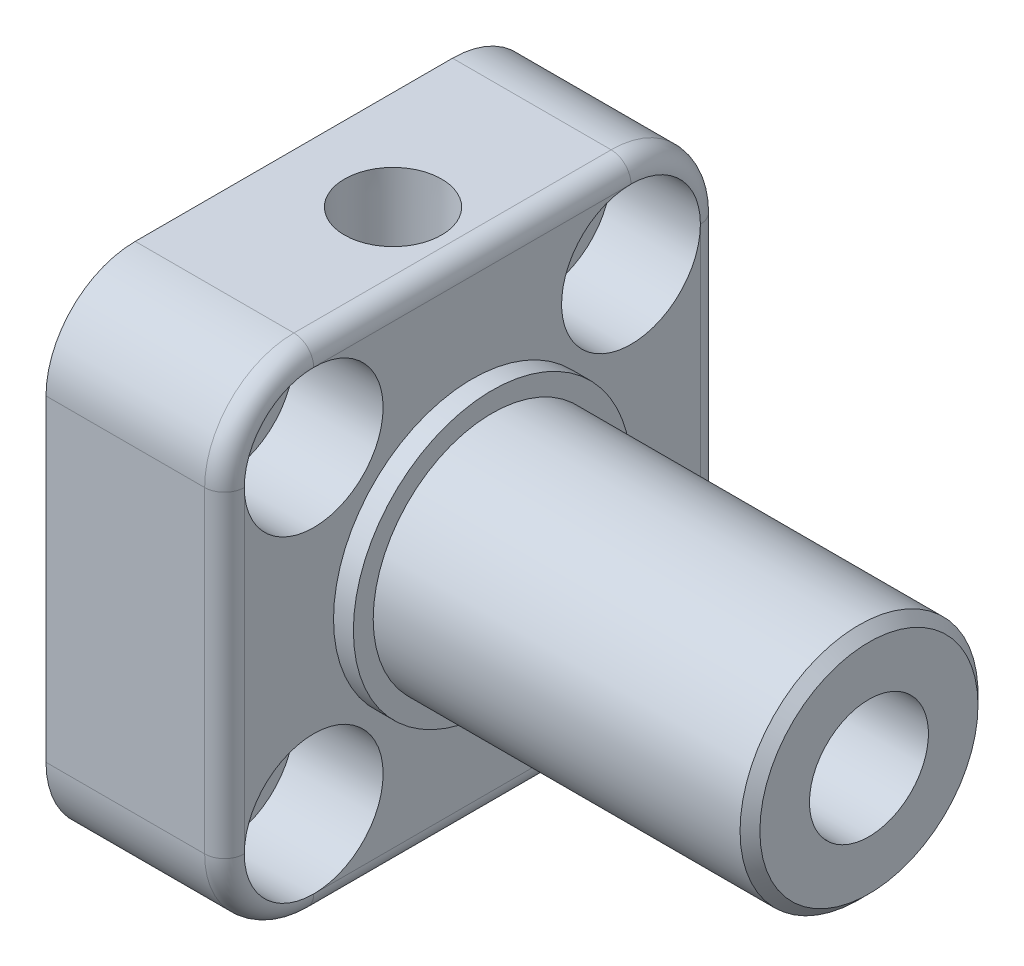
ISO-10303-21;
HEADER;
FILE_DESCRIPTION(('STEP AP214'),'2;1');
FILE_NAME('part.step','',(''),(''),'','','');
FILE_SCHEMA(('AUTOMOTIVE_DESIGN { 1 0 10303 214 1 1 1 1 }'));
ENDSEC;
DATA;
#1=APPLICATION_CONTEXT('core data for automotive mechanical design processes');
#2=APPLICATION_PROTOCOL_DEFINITION('international standard','automotive_design',2000,#1);
#3=PRODUCT_CONTEXT('',#1,'mechanical');
#4=PRODUCT('Part','Part','',(#3));
#5=PRODUCT_RELATED_PRODUCT_CATEGORY('part','',(#4));
#6=PRODUCT_DEFINITION_FORMATION('','',#4);
#7=PRODUCT_DEFINITION_CONTEXT('part definition',#1,'design');
#8=PRODUCT_DEFINITION('design','',#6,#7);
#9=PRODUCT_DEFINITION_SHAPE('','',#8);
#10=(LENGTH_UNIT() NAMED_UNIT(*) SI_UNIT(.MILLI.,.METRE.));
#11=(NAMED_UNIT(*) PLANE_ANGLE_UNIT() SI_UNIT($,.RADIAN.));
#12=(NAMED_UNIT(*) SI_UNIT($,.STERADIAN.) SOLID_ANGLE_UNIT());
#13=UNCERTAINTY_MEASURE_WITH_UNIT(LENGTH_MEASURE(1.E-05),#10,'distance_accuracy_value','');
#14=(GEOMETRIC_REPRESENTATION_CONTEXT(3) GLOBAL_UNCERTAINTY_ASSIGNED_CONTEXT((#13)) GLOBAL_UNIT_ASSIGNED_CONTEXT((#10,
#11,#12)) REPRESENTATION_CONTEXT('',''));
#15=CARTESIAN_POINT('',(0.,0.,0.));
#16=DIRECTION('',(0.,0.,1.));
#17=DIRECTION('',(1.,0.,0.));
#18=AXIS2_PLACEMENT_3D('',#15,#16,#17);
#19=CARTESIAN_POINT('',(8.,-16.,16.));
#20=DIRECTION('',(-1.,0.,0.));
#21=DIRECTION('',(0.,0.,1.));
#22=AXIS2_PLACEMENT_3D('',#19,#20,#21);
#23=CYLINDRICAL_SURFACE('',#22,4.5);
#24=CARTESIAN_POINT('',(-10.,-16.,16.));
#25=DIRECTION('',(1.,0.,0.));
#26=DIRECTION('',(0.,0.,-1.));
#27=AXIS2_PLACEMENT_3D('',#24,#25,#26);
#28=CIRCLE('',#27,4.5);
#29=CARTESIAN_POINT('',(-10.,-16.,11.5));
#30=VERTEX_POINT('',#29);
#31=EDGE_CURVE('E338',#30,#30,#28,.T.);
#32=ORIENTED_EDGE('',*,*,#31,.F.);
#33=EDGE_LOOP('',(#32));
#34=FACE_BOUND('',#33,.T.);
#35=CARTESIAN_POINT('',(-1.,-16.,16.));
#36=DIRECTION('',(1.,0.,0.));
#37=DIRECTION('',(0.,0.,-1.));
#38=AXIS2_PLACEMENT_3D('',#35,#36,#37);
#39=CIRCLE('',#38,4.5);
#40=CARTESIAN_POINT('',(-1.,-16.,11.5));
#41=VERTEX_POINT('',#40);
#42=EDGE_CURVE('E190',#41,#41,#39,.T.);
#43=ORIENTED_EDGE('',*,*,#42,.T.);
#44=EDGE_LOOP('',(#43));
#45=FACE_BOUND('',#44,.T.);
#46=ADVANCED_FACE('F28',(#34,#45),#23,.F.);
#47=CARTESIAN_POINT('',(8.,-16.,-16.));
#48=DIRECTION('',(-1.,0.,0.));
#49=DIRECTION('',(0.,0.,1.));
#50=AXIS2_PLACEMENT_3D('',#47,#48,#49);
#51=CYLINDRICAL_SURFACE('',#50,4.5);
#52=CARTESIAN_POINT('',(-10.,-16.,-16.));
#53=DIRECTION('',(1.,0.,0.));
#54=DIRECTION('',(0.,0.,-1.));
#55=AXIS2_PLACEMENT_3D('',#52,#53,#54);
#56=CIRCLE('',#55,4.5);
#57=CARTESIAN_POINT('',(-10.,-16.,-20.5));
#58=VERTEX_POINT('',#57);
#59=EDGE_CURVE('E141',#58,#58,#56,.T.);
#60=ORIENTED_EDGE('',*,*,#59,.F.);
#61=EDGE_LOOP('',(#60));
#62=FACE_BOUND('',#61,.T.);
#63=CARTESIAN_POINT('',(-1.,-16.,-16.));
#64=DIRECTION('',(1.,0.,0.));
#65=DIRECTION('',(0.,0.,-1.));
#66=AXIS2_PLACEMENT_3D('',#63,#64,#65);
#67=CIRCLE('',#66,4.5);
#68=CARTESIAN_POINT('',(-1.,-16.,-20.5));
#69=VERTEX_POINT('',#68);
#70=EDGE_CURVE('E185',#69,#69,#67,.T.);
#71=ORIENTED_EDGE('',*,*,#70,.T.);
#72=EDGE_LOOP('',(#71));
#73=FACE_BOUND('',#72,.T.);
#74=ADVANCED_FACE('F352',(#62,#73),#51,.F.);
#75=CARTESIAN_POINT('',(8.,16.,-16.));
#76=DIRECTION('',(-1.,0.,0.));
#77=DIRECTION('',(0.,0.,1.));
#78=AXIS2_PLACEMENT_3D('',#75,#76,#77);
#79=CYLINDRICAL_SURFACE('',#78,4.5);
#80=CARTESIAN_POINT('',(-10.,16.,-16.));
#81=DIRECTION('',(1.,0.,0.));
#82=DIRECTION('',(0.,0.,-1.));
#83=AXIS2_PLACEMENT_3D('',#80,#81,#82);
#84=CIRCLE('',#83,4.5);
#85=CARTESIAN_POINT('',(-10.,16.,-20.5));
#86=VERTEX_POINT('',#85);
#87=EDGE_CURVE('E144',#86,#86,#84,.T.);
#88=ORIENTED_EDGE('',*,*,#87,.F.);
#89=EDGE_LOOP('',(#88));
#90=FACE_BOUND('',#89,.T.);
#91=CARTESIAN_POINT('',(-1.,16.,-16.));
#92=DIRECTION('',(1.,0.,0.));
#93=DIRECTION('',(0.,0.,-1.));
#94=AXIS2_PLACEMENT_3D('',#91,#92,#93);
#95=CIRCLE('',#94,4.5);
#96=CARTESIAN_POINT('',(-1.,16.,-20.5));
#97=VERTEX_POINT('',#96);
#98=EDGE_CURVE('E180',#97,#97,#95,.T.);
#99=ORIENTED_EDGE('',*,*,#98,.T.);
#100=EDGE_LOOP('',(#99));
#101=FACE_BOUND('',#100,.T.);
#102=ADVANCED_FACE('F348',(#90,#101),#79,.F.);
#103=CARTESIAN_POINT('',(8.,16.,16.));
#104=DIRECTION('',(-1.,0.,0.));
#105=DIRECTION('',(0.,0.,1.));
#106=AXIS2_PLACEMENT_3D('',#103,#104,#105);
#107=CYLINDRICAL_SURFACE('',#106,4.5);
#108=CARTESIAN_POINT('',(-10.,16.,16.));
#109=DIRECTION('',(1.,0.,0.));
#110=DIRECTION('',(0.,0.,-1.));
#111=AXIS2_PLACEMENT_3D('',#108,#109,#110);
#112=CIRCLE('',#111,4.5);
#113=CARTESIAN_POINT('',(-10.,16.,11.5));
#114=VERTEX_POINT('',#113);
#115=EDGE_CURVE('E341',#114,#114,#112,.T.);
#116=ORIENTED_EDGE('',*,*,#115,.F.);
#117=EDGE_LOOP('',(#116));
#118=FACE_BOUND('',#117,.T.);
#119=CARTESIAN_POINT('',(-1.,16.,16.));
#120=DIRECTION('',(1.,0.,0.));
#121=DIRECTION('',(0.,0.,-1.));
#122=AXIS2_PLACEMENT_3D('',#119,#120,#121);
#123=CIRCLE('',#122,4.5);
#124=CARTESIAN_POINT('',(-1.,16.,11.5));
#125=VERTEX_POINT('',#124);
#126=EDGE_CURVE('E175',#125,#125,#123,.T.);
#127=ORIENTED_EDGE('',*,*,#126,.T.);
#128=EDGE_LOOP('',(#127));
#129=FACE_BOUND('',#128,.T.);
#130=ADVANCED_FACE('F351',(#118,#129),#107,.F.);
#131=CARTESIAN_POINT('',(8.,16.,-16.));
#132=DIRECTION('',(1.,0.,0.));
#133=DIRECTION('',(0.,0.,-1.));
#134=AXIS2_PLACEMENT_3D('',#131,#132,#133);
#135=PLANE('',#134);
#136=CARTESIAN_POINT('',(8.,-16.,-16.));
#137=DIRECTION('',(1.,0.,0.));
#138=DIRECTION('',(0.,0.,-1.));
#139=AXIS2_PLACEMENT_3D('',#136,#137,#138);
#140=CIRCLE('',#139,7.);
#141=CARTESIAN_POINT('',(8.,-16.,-23.));
#142=VERTEX_POINT('',#141);
#143=CARTESIAN_POINT('',(8.,-23.,-16.));
#144=VERTEX_POINT('',#143);
#145=EDGE_CURVE('E291',#142,#144,#140,.T.);
#146=ORIENTED_EDGE('',*,*,#145,.F.);
#147=DIRECTION('',(0.,1.,0.));
#148=VECTOR('',#147,1.);
#149=CARTESIAN_POINT('',(8.,15.9999999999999,-23.));
#150=LINE('',#149,#148);
#151=CARTESIAN_POINT('',(8.,16.,-23.));
#152=VERTEX_POINT('',#151);
#153=EDGE_CURVE('E200',#142,#152,#150,.T.);
#154=ORIENTED_EDGE('',*,*,#153,.T.);
#155=CARTESIAN_POINT('',(8.,16.,-16.));
#156=DIRECTION('',(1.,0.,0.));
#157=DIRECTION('',(0.,0.,-1.));
#158=AXIS2_PLACEMENT_3D('',#155,#156,#157);
#159=CIRCLE('',#158,7.);
#160=CARTESIAN_POINT('',(8.,23.,-16.));
#161=VERTEX_POINT('',#160);
#162=EDGE_CURVE('E188',#161,#152,#159,.T.);
#163=ORIENTED_EDGE('',*,*,#162,.F.);
#164=DIRECTION('',(0.,0.,1.));
#165=VECTOR('',#164,1.);
#166=CARTESIAN_POINT('',(8.,23.,15.9999999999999));
#167=LINE('',#166,#165);
#168=CARTESIAN_POINT('',(8.,23.,16.));
#169=VERTEX_POINT('',#168);
#170=EDGE_CURVE('E124',#161,#169,#167,.T.);
#171=ORIENTED_EDGE('',*,*,#170,.T.);
#172=CARTESIAN_POINT('',(8.,16.,16.));
#173=DIRECTION('',(1.,0.,0.));
#174=DIRECTION('',(0.,0.,-1.));
#175=AXIS2_PLACEMENT_3D('',#172,#173,#174);
#176=CIRCLE('',#175,7.);
#177=CARTESIAN_POINT('',(8.,15.9999999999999,23.));
#178=VERTEX_POINT('',#177);
#179=EDGE_CURVE('E183',#178,#169,#176,.T.);
#180=ORIENTED_EDGE('',*,*,#179,.F.);
#181=DIRECTION('',(0.,-1.,0.));
#182=VECTOR('',#181,1.);
#183=CARTESIAN_POINT('',(8.,-15.9999999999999,23.));
#184=LINE('',#183,#182);
#185=CARTESIAN_POINT('',(8.,-16.,23.));
#186=VERTEX_POINT('',#185);
#187=EDGE_CURVE('E196',#178,#186,#184,.T.);
#188=ORIENTED_EDGE('',*,*,#187,.T.);
#189=CARTESIAN_POINT('',(8.,-16.,16.));
#190=DIRECTION('',(1.,0.,0.));
#191=DIRECTION('',(0.,0.,-1.));
#192=AXIS2_PLACEMENT_3D('',#189,#190,#191);
#193=CIRCLE('',#192,7.);
#194=CARTESIAN_POINT('',(8.,-23.,15.9999999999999));
#195=VERTEX_POINT('',#194);
#196=EDGE_CURVE('E286',#195,#186,#193,.T.);
#197=ORIENTED_EDGE('',*,*,#196,.F.);
#198=DIRECTION('',(0.,0.,-1.));
#199=VECTOR('',#198,1.);
#200=CARTESIAN_POINT('',(8.,-23.,-15.9999999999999));
#201=LINE('',#200,#199);
#202=EDGE_CURVE('E198',#195,#144,#201,.T.);
#203=ORIENTED_EDGE('',*,*,#202,.T.);
#204=EDGE_LOOP('',(#146,#154,#163,#171,#180,#188,#197,#203));
#205=FACE_BOUND('',#204,.T.);
#206=CARTESIAN_POINT('',(8.,0.,0.));
#207=DIRECTION('',(-1.,0.,0.));
#208=DIRECTION('',(0.,0.,1.));
#209=AXIS2_PLACEMENT_3D('',#206,#207,#208);
#210=CIRCLE('',#209,14.);
#211=CARTESIAN_POINT('',(8.,0.,14.));
#212=VERTEX_POINT('',#211);
#213=EDGE_CURVE('E335',#212,#212,#210,.T.);
#214=ORIENTED_EDGE('',*,*,#213,.T.);
#215=EDGE_LOOP('',(#214));
#216=FACE_BOUND('',#215,.T.);
#217=ADVANCED_FACE('F414',(#205,#216),#135,.T.);
#218=CARTESIAN_POINT('',(-10.,16.,-16.));
#219=DIRECTION('',(1.,0.,0.));
#220=DIRECTION('',(0.,0.,-1.));
#221=AXIS2_PLACEMENT_3D('',#218,#219,#220);
#222=PLANE('',#221);
#223=CARTESIAN_POINT('',(-10.,16.,0.));
#224=DIRECTION('',(-1.,0.,0.));
#225=DIRECTION('',(0.,0.,1.));
#226=AXIS2_PLACEMENT_3D('',#223,#224,#225);
#227=CIRCLE('',#226,2.);
#228=CARTESIAN_POINT('',(-10.,16.,2.));
#229=VERTEX_POINT('',#228);
#230=EDGE_CURVE('E246',#229,#229,#227,.T.);
#231=ORIENTED_EDGE('',*,*,#230,.F.);
#232=EDGE_LOOP('',(#231));
#233=FACE_BOUND('',#232,.T.);
#234=CARTESIAN_POINT('',(-10.,0.,0.));
#235=DIRECTION('',(-1.,0.,0.));
#236=DIRECTION('',(0.,0.,1.));
#237=AXIS2_PLACEMENT_3D('',#234,#235,#236);
#238=CIRCLE('',#237,11.15);
#239=CARTESIAN_POINT('',(-10.,0.,11.15));
#240=VERTEX_POINT('',#239);
#241=EDGE_CURVE('E308',#240,#240,#238,.T.);
#242=ORIENTED_EDGE('',*,*,#241,.F.);
#243=EDGE_LOOP('',(#242));
#244=FACE_BOUND('',#243,.T.);
#245=CARTESIAN_POINT('',(-10.,16.,-16.));
#246=DIRECTION('',(1.,0.,0.));
#247=DIRECTION('',(0.,0.,-1.));
#248=AXIS2_PLACEMENT_3D('',#245,#246,#247);
#249=CIRCLE('',#248,9.);
#250=CARTESIAN_POINT('',(-10.,15.9999999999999,-25.));
#251=VERTEX_POINT('',#250);
#252=CARTESIAN_POINT('',(-10.,25.,-15.9999999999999));
#253=VERTEX_POINT('',#252);
#254=EDGE_CURVE('E133',#251,#253,#249,.T.);
#255=ORIENTED_EDGE('',*,*,#254,.F.);
#256=DIRECTION('',(0.,1.,0.));
#257=VECTOR('',#256,1.);
#258=CARTESIAN_POINT('',(-10.,-15.9999999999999,-25.));
#259=LINE('',#258,#257);
#260=CARTESIAN_POINT('',(-10.,-15.9999999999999,-25.));
#261=VERTEX_POINT('',#260);
#262=EDGE_CURVE('E161',#261,#251,#259,.T.);
#263=ORIENTED_EDGE('',*,*,#262,.F.);
#264=CARTESIAN_POINT('',(-10.,-16.,-16.));
#265=DIRECTION('',(1.,0.,0.));
#266=DIRECTION('',(0.,0.,-1.));
#267=AXIS2_PLACEMENT_3D('',#264,#265,#266);
#268=CIRCLE('',#267,9.);
#269=CARTESIAN_POINT('',(-10.,-25.,-15.9999999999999));
#270=VERTEX_POINT('',#269);
#271=EDGE_CURVE('E158',#270,#261,#268,.T.);
#272=ORIENTED_EDGE('',*,*,#271,.F.);
#273=DIRECTION('',(0.,0.,-1.));
#274=VECTOR('',#273,1.);
#275=CARTESIAN_POINT('',(-10.,-25.,15.9999999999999));
#276=LINE('',#275,#274);
#277=CARTESIAN_POINT('',(-10.,-25.,15.9999999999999));
#278=VERTEX_POINT('',#277);
#279=EDGE_CURVE('E155',#278,#270,#276,.T.);
#280=ORIENTED_EDGE('',*,*,#279,.F.);
#281=CARTESIAN_POINT('',(-10.,-16.,16.));
#282=DIRECTION('',(1.,0.,0.));
#283=DIRECTION('',(0.,0.,1.));
#284=AXIS2_PLACEMENT_3D('',#281,#282,#283);
#285=CIRCLE('',#284,9.);
#286=CARTESIAN_POINT('',(-10.,-15.9999999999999,25.));
#287=VERTEX_POINT('',#286);
#288=EDGE_CURVE('E152',#287,#278,#285,.T.);
#289=ORIENTED_EDGE('',*,*,#288,.F.);
#290=DIRECTION('',(0.,-1.,0.));
#291=VECTOR('',#290,1.);
#292=CARTESIAN_POINT('',(-10.,15.9999999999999,25.));
#293=LINE('',#292,#291);
#294=CARTESIAN_POINT('',(-10.,15.9999999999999,25.));
#295=VERTEX_POINT('',#294);
#296=EDGE_CURVE('E149',#295,#287,#293,.T.);
#297=ORIENTED_EDGE('',*,*,#296,.F.);
#298=CARTESIAN_POINT('',(-10.,16.,16.));
#299=DIRECTION('',(1.,0.,0.));
#300=DIRECTION('',(0.,0.,1.));
#301=AXIS2_PLACEMENT_3D('',#298,#299,#300);
#302=CIRCLE('',#301,9.);
#303=CARTESIAN_POINT('',(-10.,25.,15.9999999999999));
#304=VERTEX_POINT('',#303);
#305=EDGE_CURVE('E137',#304,#295,#302,.T.);
#306=ORIENTED_EDGE('',*,*,#305,.F.);
#307=DIRECTION('',(0.,0.,1.));
#308=VECTOR('',#307,1.);
#309=CARTESIAN_POINT('',(-10.,25.,-15.9999999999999));
#310=LINE('',#309,#308);
#311=EDGE_CURVE('E119',#253,#304,#310,.T.);
#312=ORIENTED_EDGE('',*,*,#311,.F.);
#313=EDGE_LOOP('',(#255,#263,#272,#280,#289,#297,#306,#312));
#314=FACE_BOUND('',#313,.T.);
#315=ORIENTED_EDGE('',*,*,#59,.T.);
#316=EDGE_LOOP('',(#315));
#317=FACE_BOUND('',#316,.T.);
#318=ORIENTED_EDGE('',*,*,#87,.T.);
#319=EDGE_LOOP('',(#318));
#320=FACE_BOUND('',#319,.T.);
#321=ORIENTED_EDGE('',*,*,#115,.T.);
#322=EDGE_LOOP('',(#321));
#323=FACE_BOUND('',#322,.T.);
#324=ORIENTED_EDGE('',*,*,#31,.T.);
#325=EDGE_LOOP('',(#324));
#326=FACE_BOUND('',#325,.T.);
#327=ADVANCED_FACE('F130',(#233,#244,#314,#317,#320,#323,#326),#222,.F.);
#328=CARTESIAN_POINT('',(8.,16.,-16.));
#329=DIRECTION('',(-1.,0.,0.));
#330=DIRECTION('',(0.,0.,1.));
#331=AXIS2_PLACEMENT_3D('',#328,#329,#330);
#332=CYLINDRICAL_SURFACE('',#331,9.);
#333=DIRECTION('',(-1.,0.,0.));
#334=VECTOR('',#333,1.);
#335=CARTESIAN_POINT('',(8.,25.,-15.9999999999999));
#336=LINE('',#335,#334);
#337=CARTESIAN_POINT('',(6.,25.,-15.9999999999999));
#338=VERTEX_POINT('',#337);
#339=EDGE_CURVE('E116',#338,#253,#336,.T.);
#340=ORIENTED_EDGE('',*,*,#339,.F.);
#341=CARTESIAN_POINT('',(6.,16.,-16.));
#342=DIRECTION('',(1.,0.,0.));
#343=DIRECTION('',(0.,0.,-1.));
#344=AXIS2_PLACEMENT_3D('',#341,#342,#343);
#345=CIRCLE('',#344,9.);
#346=CARTESIAN_POINT('',(6.,15.9999999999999,-25.));
#347=VERTEX_POINT('',#346);
#348=EDGE_CURVE('E207',#338,#347,#345,.F.);
#349=ORIENTED_EDGE('',*,*,#348,.T.);
#350=DIRECTION('',(-1.,0.,0.));
#351=VECTOR('',#350,1.);
#352=CARTESIAN_POINT('',(8.,15.9999999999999,-25.));
#353=LINE('',#352,#351);
#354=EDGE_CURVE('E140',#347,#251,#353,.T.);
#355=ORIENTED_EDGE('',*,*,#354,.T.);
#356=ORIENTED_EDGE('',*,*,#254,.T.);
#357=EDGE_LOOP('',(#340,#349,#355,#356));
#358=FACE_BOUND('',#357,.T.);
#359=ADVANCED_FACE('F30',(#358),#332,.T.);
#360=CARTESIAN_POINT('',(8.,25.,-15.9999999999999));
#361=DIRECTION('',(0.,-1.,0.));
#362=DIRECTION('',(0.,0.,-1.));
#363=AXIS2_PLACEMENT_3D('',#360,#361,#362);
#364=PLANE('',#363);
#365=CARTESIAN_POINT('',(0.,25.,0.));
#366=DIRECTION('',(0.,1.,0.));
#367=DIRECTION('',(0.,0.,1.));
#368=AXIS2_PLACEMENT_3D('',#365,#366,#367);
#369=CIRCLE('',#368,4.8967009);
#370=CARTESIAN_POINT('',(0.,25.,4.89670089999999));
#371=VERTEX_POINT('',#370);
#372=EDGE_CURVE('E256',#371,#371,#369,.T.);
#373=ORIENTED_EDGE('',*,*,#372,.F.);
#374=EDGE_LOOP('',(#373));
#375=FACE_BOUND('',#374,.T.);
#376=DIRECTION('',(-1.,0.,0.));
#377=VECTOR('',#376,1.);
#378=CARTESIAN_POINT('',(8.,25.,15.9999999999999));
#379=LINE('',#378,#377);
#380=CARTESIAN_POINT('',(6.,25.,15.9999999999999));
#381=VERTEX_POINT('',#380);
#382=EDGE_CURVE('E125',#381,#304,#379,.T.);
#383=ORIENTED_EDGE('',*,*,#382,.F.);
#384=DIRECTION('',(0.,0.,1.));
#385=VECTOR('',#384,1.);
#386=CARTESIAN_POINT('',(6.,25.,-15.9999999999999));
#387=LINE('',#386,#385);
#388=EDGE_CURVE('E11',#381,#338,#387,.F.);
#389=ORIENTED_EDGE('',*,*,#388,.T.);
#390=ORIENTED_EDGE('',*,*,#339,.T.);
#391=ORIENTED_EDGE('',*,*,#311,.T.);
#392=EDGE_LOOP('',(#383,#389,#390,#391));
#393=FACE_BOUND('',#392,.T.);
#394=ADVANCED_FACE('F118',(#375,#393),#364,.F.);
#395=CARTESIAN_POINT('',(8.,16.,16.));
#396=DIRECTION('',(-1.,0.,0.));
#397=DIRECTION('',(0.,0.,1.));
#398=AXIS2_PLACEMENT_3D('',#395,#396,#397);
#399=CYLINDRICAL_SURFACE('',#398,9.);
#400=DIRECTION('',(-1.,0.,0.));
#401=VECTOR('',#400,1.);
#402=CARTESIAN_POINT('',(8.,15.9999999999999,25.));
#403=LINE('',#402,#401);
#404=CARTESIAN_POINT('',(6.,15.9999999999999,25.));
#405=VERTEX_POINT('',#404);
#406=EDGE_CURVE('E172',#405,#295,#403,.T.);
#407=ORIENTED_EDGE('',*,*,#406,.F.);
#408=CARTESIAN_POINT('',(6.,16.,16.));
#409=DIRECTION('',(1.,0.,0.));
#410=DIRECTION('',(0.,0.,-1.));
#411=AXIS2_PLACEMENT_3D('',#408,#409,#410);
#412=CIRCLE('',#411,9.);
#413=EDGE_CURVE('E36',#405,#381,#412,.F.);
#414=ORIENTED_EDGE('',*,*,#413,.T.);
#415=ORIENTED_EDGE('',*,*,#382,.T.);
#416=ORIENTED_EDGE('',*,*,#305,.T.);
#417=EDGE_LOOP('',(#407,#414,#415,#416));
#418=FACE_BOUND('',#417,.T.);
#419=ADVANCED_FACE('F467',(#418),#399,.T.);
#420=CARTESIAN_POINT('',(8.,15.9999999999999,25.));
#421=DIRECTION('',(0.,0.,-1.));
#422=DIRECTION('',(0.,1.,0.));
#423=AXIS2_PLACEMENT_3D('',#420,#421,#422);
#424=PLANE('',#423);
#425=DIRECTION('',(-1.,0.,0.));
#426=VECTOR('',#425,1.);
#427=CARTESIAN_POINT('',(8.,-15.9999999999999,25.));
#428=LINE('',#427,#426);
#429=CARTESIAN_POINT('',(6.,-15.9999999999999,25.));
#430=VERTEX_POINT('',#429);
#431=EDGE_CURVE('E170',#430,#287,#428,.T.);
#432=ORIENTED_EDGE('',*,*,#431,.F.);
#433=DIRECTION('',(0.,-1.,0.));
#434=VECTOR('',#433,1.);
#435=CARTESIAN_POINT('',(6.,15.9999999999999,25.));
#436=LINE('',#435,#434);
#437=EDGE_CURVE('E50',#430,#405,#436,.F.);
#438=ORIENTED_EDGE('',*,*,#437,.T.);
#439=ORIENTED_EDGE('',*,*,#406,.T.);
#440=ORIENTED_EDGE('',*,*,#296,.T.);
#441=EDGE_LOOP('',(#432,#438,#439,#440));
#442=FACE_BOUND('',#441,.T.);
#443=ADVANCED_FACE('F222',(#442),#424,.F.);
#444=CARTESIAN_POINT('',(8.,-16.,16.));
#445=DIRECTION('',(-1.,0.,0.));
#446=DIRECTION('',(0.,0.,1.));
#447=AXIS2_PLACEMENT_3D('',#444,#445,#446);
#448=CYLINDRICAL_SURFACE('',#447,9.);
#449=DIRECTION('',(-1.,0.,0.));
#450=VECTOR('',#449,1.);
#451=CARTESIAN_POINT('',(8.,-25.,15.9999999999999));
#452=LINE('',#451,#450);
#453=CARTESIAN_POINT('',(6.,-25.,15.9999999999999));
#454=VERTEX_POINT('',#453);
#455=EDGE_CURVE('E168',#454,#278,#452,.T.);
#456=ORIENTED_EDGE('',*,*,#455,.F.);
#457=CARTESIAN_POINT('',(6.,-16.,16.));
#458=DIRECTION('',(1.,0.,0.));
#459=DIRECTION('',(0.,0.,-1.));
#460=AXIS2_PLACEMENT_3D('',#457,#458,#459);
#461=CIRCLE('',#460,9.);
#462=EDGE_CURVE('E211',#454,#430,#461,.F.);
#463=ORIENTED_EDGE('',*,*,#462,.T.);
#464=ORIENTED_EDGE('',*,*,#431,.T.);
#465=ORIENTED_EDGE('',*,*,#288,.T.);
#466=EDGE_LOOP('',(#456,#463,#464,#465));
#467=FACE_BOUND('',#466,.T.);
#468=ADVANCED_FACE('F216',(#467),#448,.T.);
#469=CARTESIAN_POINT('',(8.,-25.,15.9999999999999));
#470=DIRECTION('',(0.,1.,0.));
#471=DIRECTION('',(0.,0.,1.));
#472=AXIS2_PLACEMENT_3D('',#469,#470,#471);
#473=PLANE('',#472);
#474=DIRECTION('',(-1.,0.,0.));
#475=VECTOR('',#474,1.);
#476=CARTESIAN_POINT('',(8.,-25.,-15.9999999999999));
#477=LINE('',#476,#475);
#478=CARTESIAN_POINT('',(6.,-25.,-15.9999999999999));
#479=VERTEX_POINT('',#478);
#480=EDGE_CURVE('E166',#479,#270,#477,.T.);
#481=ORIENTED_EDGE('',*,*,#480,.F.);
#482=DIRECTION('',(0.,0.,-1.));
#483=VECTOR('',#482,1.);
#484=CARTESIAN_POINT('',(6.,-25.,15.9999999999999));
#485=LINE('',#484,#483);
#486=EDGE_CURVE('E209',#479,#454,#485,.F.);
#487=ORIENTED_EDGE('',*,*,#486,.T.);
#488=ORIENTED_EDGE('',*,*,#455,.T.);
#489=ORIENTED_EDGE('',*,*,#279,.T.);
#490=EDGE_LOOP('',(#481,#487,#488,#489));
#491=FACE_BOUND('',#490,.T.);
#492=ADVANCED_FACE('F391',(#491),#473,.F.);
#493=CARTESIAN_POINT('',(8.,-16.,-16.));
#494=DIRECTION('',(-1.,0.,0.));
#495=DIRECTION('',(0.,0.,1.));
#496=AXIS2_PLACEMENT_3D('',#493,#494,#495);
#497=CYLINDRICAL_SURFACE('',#496,9.);
#498=DIRECTION('',(-1.,0.,0.));
#499=VECTOR('',#498,1.);
#500=CARTESIAN_POINT('',(8.,-15.9999999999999,-25.));
#501=LINE('',#500,#499);
#502=CARTESIAN_POINT('',(6.,-15.9999999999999,-25.));
#503=VERTEX_POINT('',#502);
#504=EDGE_CURVE('E164',#503,#261,#501,.T.);
#505=ORIENTED_EDGE('',*,*,#504,.F.);
#506=CARTESIAN_POINT('',(6.,-16.,-16.));
#507=DIRECTION('',(1.,0.,0.));
#508=DIRECTION('',(0.,0.,-1.));
#509=AXIS2_PLACEMENT_3D('',#506,#507,#508);
#510=CIRCLE('',#509,9.);
#511=EDGE_CURVE('E202',#503,#479,#510,.F.);
#512=ORIENTED_EDGE('',*,*,#511,.T.);
#513=ORIENTED_EDGE('',*,*,#480,.T.);
#514=ORIENTED_EDGE('',*,*,#271,.T.);
#515=EDGE_LOOP('',(#505,#512,#513,#514));
#516=FACE_BOUND('',#515,.T.);
#517=ADVANCED_FACE('F400',(#516),#497,.T.);
#518=CARTESIAN_POINT('',(8.,-15.9999999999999,-25.));
#519=DIRECTION('',(0.,0.,1.));
#520=DIRECTION('',(0.,-1.,0.));
#521=AXIS2_PLACEMENT_3D('',#518,#519,#520);
#522=PLANE('',#521);
#523=ORIENTED_EDGE('',*,*,#354,.F.);
#524=DIRECTION('',(0.,1.,0.));
#525=VECTOR('',#524,1.);
#526=CARTESIAN_POINT('',(6.,-15.9999999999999,-25.));
#527=LINE('',#526,#525);
#528=EDGE_CURVE('E205',#347,#503,#527,.F.);
#529=ORIENTED_EDGE('',*,*,#528,.T.);
#530=ORIENTED_EDGE('',*,*,#504,.T.);
#531=ORIENTED_EDGE('',*,*,#262,.T.);
#532=EDGE_LOOP('',(#523,#529,#530,#531));
#533=FACE_BOUND('',#532,.T.);
#534=ADVANCED_FACE('F384',(#533),#522,.F.);
#535=CARTESIAN_POINT('',(-12.,6.,0.));
#536=DIRECTION('',(1.,0.,0.));
#537=DIRECTION('',(0.,0.,-1.));
#538=AXIS2_PLACEMENT_3D('',#535,#536,#537);
#539=PLANE('',#538);
#540=CARTESIAN_POINT('',(-12.,0.,0.));
#541=DIRECTION('',(-1.,0.,0.));
#542=DIRECTION('',(0.,0.,1.));
#543=AXIS2_PLACEMENT_3D('',#540,#541,#542);
#544=CIRCLE('',#543,6.);
#545=CARTESIAN_POINT('',(-12.,0.,6.));
#546=VERTEX_POINT('',#545);
#547=EDGE_CURVE('E317',#546,#546,#544,.T.);
#548=ORIENTED_EDGE('',*,*,#547,.F.);
#549=EDGE_LOOP('',(#548));
#550=FACE_BOUND('',#549,.T.);
#551=CARTESIAN_POINT('',(-12.,0.,0.));
#552=DIRECTION('',(-1.,0.,0.));
#553=DIRECTION('',(0.,0.,1.));
#554=AXIS2_PLACEMENT_3D('',#551,#552,#553);
#555=CIRCLE('',#554,8.);
#556=CARTESIAN_POINT('',(-12.,0.,8.));
#557=VERTEX_POINT('',#556);
#558=EDGE_CURVE('E314',#557,#557,#555,.T.);
#559=ORIENTED_EDGE('',*,*,#558,.T.);
#560=EDGE_LOOP('',(#559));
#561=FACE_BOUND('',#560,.T.);
#562=ADVANCED_FACE('F458',(#550,#561),#539,.F.);
#563=CARTESIAN_POINT('',(0.,0.,0.));
#564=DIRECTION('',(-1.,0.,0.));
#565=DIRECTION('',(0.,0.,1.));
#566=AXIS2_PLACEMENT_3D('',#563,#564,#565);
#567=CYLINDRICAL_SURFACE('',#566,8.);
#568=ORIENTED_EDGE('',*,*,#558,.F.);
#569=EDGE_LOOP('',(#568));
#570=FACE_BOUND('',#569,.T.);
#571=CARTESIAN_POINT('',(-8.,0.,0.));
#572=DIRECTION('',(-1.,0.,0.));
#573=DIRECTION('',(0.,0.,1.));
#574=AXIS2_PLACEMENT_3D('',#571,#572,#573);
#575=CIRCLE('',#574,8.);
#576=CARTESIAN_POINT('',(-8.,0.,8.));
#577=VERTEX_POINT('',#576);
#578=EDGE_CURVE('E178',#577,#577,#575,.T.);
#579=ORIENTED_EDGE('',*,*,#578,.T.);
#580=EDGE_LOOP('',(#579));
#581=FACE_BOUND('',#580,.T.);
#582=ADVANCED_FACE('F452',(#570,#581),#567,.T.);
#583=CARTESIAN_POINT('',(8.,0.,0.));
#584=DIRECTION('',(-1.,0.,0.));
#585=DIRECTION('',(0.,0.,1.));
#586=AXIS2_PLACEMENT_3D('',#583,#584,#585);
#587=CYLINDRICAL_SURFACE('',#586,6.);
#588=CARTESIAN_POINT('',(0.,4.26872007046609,4.2164));
#589=CARTESIAN_POINT('',(-0.101064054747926,4.26872006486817,4.21640000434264));
#590=CARTESIAN_POINT('',(-0.202131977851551,4.27232640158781,4.2127582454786));
#591=CARTESIAN_POINT('',(-0.40325198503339,4.28655050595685,4.19828366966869));
#592=CARTESIAN_POINT('',(-0.503303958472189,4.29716902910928,4.18745007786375));
#593=CARTESIAN_POINT('',(-0.701660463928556,4.32488544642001,4.1588171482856));
#594=CARTESIAN_POINT('',(-0.799961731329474,4.34199433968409,4.14100598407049));
#595=CARTESIAN_POINT('',(-0.993976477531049,4.38188658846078,4.09876959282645));
#596=CARTESIAN_POINT('',(-1.08968851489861,4.40467303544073,4.07434076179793));
#597=CARTESIAN_POINT('',(-1.36990713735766,4.47956478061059,3.9923583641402));
#598=CARTESIAN_POINT('',(-1.54998305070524,4.53859164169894,3.92573367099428));
#599=CARTESIAN_POINT('',(-1.89586000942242,4.66802111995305,3.77090724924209));
#600=CARTESIAN_POINT('',(-2.06166030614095,4.73842433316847,3.68270438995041));
#601=CARTESIAN_POINT('',(-2.40651436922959,4.89754213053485,3.46912166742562));
#602=CARTESIAN_POINT('',(-2.58272740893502,4.98729329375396,3.33992580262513));
#603=CARTESIAN_POINT('',(-2.913583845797,5.16639183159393,3.05559438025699));
#604=CARTESIAN_POINT('',(-3.06819988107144,5.25573855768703,2.90042645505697));
#605=CARTESIAN_POINT('',(-3.29393209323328,5.39143523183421,2.63525098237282));
#606=CARTESIAN_POINT('',(-3.37307040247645,5.44024001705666,2.53322858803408));
#607=CARTESIAN_POINT('',(-3.52234663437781,5.53403263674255,2.32118587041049));
#608=CARTESIAN_POINT('',(-3.59248861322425,5.5790221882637,2.21116918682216));
#609=CARTESIAN_POINT('',(-3.72289279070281,5.66387286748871,1.98374568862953));
#610=CARTESIAN_POINT('',(-3.78316796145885,5.70374071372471,1.86634886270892));
#611=CARTESIAN_POINT('',(-3.89300914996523,5.77718168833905,1.62484302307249));
#612=CARTESIAN_POINT('',(-3.94257988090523,5.8107575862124,1.50073699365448));
#613=CARTESIAN_POINT('',(-4.05012280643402,5.88415363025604,1.1885997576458));
#614=CARTESIAN_POINT('',(-4.10159325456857,5.91982277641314,0.997258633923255));
#615=CARTESIAN_POINT('',(-4.17722599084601,5.97247440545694,0.606882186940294));
#616=CARTESIAN_POINT('',(-4.20141018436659,5.98947187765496,0.407853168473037));
#617=CARTESIAN_POINT('',(-4.22116704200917,6.00334644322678,0.0072477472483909));
#618=CARTESIAN_POINT('',(-4.21668317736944,6.00018378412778,-0.19433290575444));
#619=CARTESIAN_POINT('',(-4.17923351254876,5.97392583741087,-0.593511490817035));
#620=CARTESIAN_POINT('',(-4.14625983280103,5.95082503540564,-0.791108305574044));
#621=CARTESIAN_POINT('',(-4.05478824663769,5.8874633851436,-1.17229333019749));
#622=CARTESIAN_POINT('',(-3.99690610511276,5.84761702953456,-1.35610122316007));
#623=CARTESIAN_POINT('',(-3.85835307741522,5.75380447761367,-1.71098518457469));
#624=CARTESIAN_POINT('',(-3.7776776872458,5.69983549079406,-1.88205872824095));
#625=CARTESIAN_POINT('',(-3.58604682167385,5.57457177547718,-2.22745693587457));
#626=CARTESIAN_POINT('',(-3.47271045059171,5.50201289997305,-2.39999541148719));
#627=CARTESIAN_POINT('',(-3.22431803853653,5.34870480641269,-2.72464364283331));
#628=CARTESIAN_POINT('',(-3.08923885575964,5.26794689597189,-2.8767313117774));
#629=CARTESIAN_POINT('',(-2.773488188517,5.08864290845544,-3.18477611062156));
#630=CARTESIAN_POINT('',(-2.58898590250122,4.98950869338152,-3.33651485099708));
#631=CARTESIAN_POINT('',(-2.29372703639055,4.84518826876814,-3.53993251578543));
#632=CARTESIAN_POINT('',(-2.19218200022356,4.79779481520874,-3.60372586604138));
#633=CARTESIAN_POINT('',(-1.98304698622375,4.70591084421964,-3.7229090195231));
#634=CARTESIAN_POINT('',(-1.87545806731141,4.66141982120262,-3.77830028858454));
#635=CARTESIAN_POINT('',(-1.59480607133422,4.55419917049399,-3.90763675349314));
#636=CARTESIAN_POINT('',(-1.41764008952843,4.49452376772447,-3.97554661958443));
#637=CARTESIAN_POINT('',(-1.14304160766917,4.41823332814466,-4.05963717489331));
#638=CARTESIAN_POINT('',(-1.05006799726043,4.3950127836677,-4.08469931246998));
#639=CARTESIAN_POINT('',(-0.861532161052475,4.35382138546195,-4.12857656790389));
#640=CARTESIAN_POINT('',(-0.765971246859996,4.3358479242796,-4.14739478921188));
#641=CARTESIAN_POINT('',(-0.571788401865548,4.30576558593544,-4.17861962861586));
#642=CARTESIAN_POINT('',(-0.473144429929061,4.29372295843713,-4.19095391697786));
#643=CARTESIAN_POINT('',(-0.274635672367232,4.27640301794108,-4.20862587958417));
#644=CARTESIAN_POINT('',(-0.174770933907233,4.27112544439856,-4.21396382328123));
#645=CARTESIAN_POINT('',(0.0251807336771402,4.26762513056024,-4.21750927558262));
#646=CARTESIAN_POINT('',(0.125267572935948,4.26939992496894,-4.21571927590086));
#647=CARTESIAN_POINT('',(0.32466680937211,4.27988806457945,-4.20506898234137));
#648=CARTESIAN_POINT('',(0.423979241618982,4.28860109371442,-4.19620901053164));
#649=CARTESIAN_POINT('',(0.691238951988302,4.32109308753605,-4.16281918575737));
#650=CARTESIAN_POINT('',(0.857647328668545,4.35118420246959,-4.13162133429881));
#651=CARTESIAN_POINT('',(1.18221288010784,4.42656684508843,-4.05074302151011));
#652=CARTESIAN_POINT('',(1.34036097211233,4.47187471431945,-4.00104268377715));
#653=CARTESIAN_POINT('',(1.71941011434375,4.59704733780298,-3.85745027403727));
#654=CARTESIAN_POINT('',(1.93460962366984,4.68312068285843,-3.75377496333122));
#655=CARTESIAN_POINT('',(2.2396146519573,4.81970821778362,-3.57437227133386));
#656=CARTESIAN_POINT('',(2.33844272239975,4.86655427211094,-3.51048382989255));
#657=CARTESIAN_POINT('',(2.53004865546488,4.96147159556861,-3.37500145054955));
#658=CARTESIAN_POINT('',(2.62282722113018,5.00954272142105,-3.30340841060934));
#659=CARTESIAN_POINT('',(2.89525176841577,5.15563297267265,-3.07450171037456));
#660=CARTESIAN_POINT('',(3.0651344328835,5.2537192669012,-2.90532849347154));
#661=CARTESIAN_POINT('',(3.37558376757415,5.44070614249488,-2.53794856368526));
#662=CARTESIAN_POINT('',(3.5161929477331,5.52961994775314,-2.33978467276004));
#663=CARTESIAN_POINT('',(3.74388306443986,5.67735797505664,-1.95031674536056));
#664=CARTESIAN_POINT('',(3.83591806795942,5.73871815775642,-1.76291793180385));
#665=CARTESIAN_POINT('',(3.95318474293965,5.81797446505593,-1.47018640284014));
#666=CARTESIAN_POINT('',(3.9888162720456,5.84226749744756,-1.37064134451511));
#667=CARTESIAN_POINT('',(4.0527216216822,5.88608344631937,-1.16821354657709));
#668=CARTESIAN_POINT('',(4.08099863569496,5.90560843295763,-1.06533227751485));
#669=CARTESIAN_POINT('',(4.12995181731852,5.93954211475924,-0.856231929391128));
#670=CARTESIAN_POINT('',(4.15057805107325,5.95391717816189,-0.749995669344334));
#671=CARTESIAN_POINT('',(4.18363609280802,5.97700942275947,-0.535691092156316));
#672=CARTESIAN_POINT('',(4.19607160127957,5.98572915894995,-0.427623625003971));
#673=CARTESIAN_POINT('',(4.21254628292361,5.99728961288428,-0.210546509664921));
#674=CARTESIAN_POINT('',(4.21658630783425,6.00013092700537,-0.101536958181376));
#675=CARTESIAN_POINT('',(4.21620050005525,5.9998598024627,0.116453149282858));
#676=CARTESIAN_POINT('',(4.21177532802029,5.99674782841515,0.225433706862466));
#677=CARTESIAN_POINT('',(4.1953928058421,5.98525366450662,0.431647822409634));
#678=CARTESIAN_POINT('',(4.18422476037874,5.97742390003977,0.528975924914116));
#679=CARTESIAN_POINT('',(4.15524556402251,5.95717493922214,0.722163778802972));
#680=CARTESIAN_POINT('',(4.13743230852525,5.94475428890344,0.818023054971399));
#681=CARTESIAN_POINT('',(4.07435335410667,5.90096426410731,1.1023980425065));
#682=CARTESIAN_POINT('',(4.01943472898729,5.86305691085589,1.28787774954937));
#683=CARTESIAN_POINT('',(3.88423040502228,5.77119444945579,1.65223088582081));
#684=CARTESIAN_POINT('',(3.80317066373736,5.71675308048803,1.83068714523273));
#685=CARTESIAN_POINT('',(3.6193290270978,5.59613275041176,2.17163895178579));
#686=CARTESIAN_POINT('',(3.51654300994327,5.52995156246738,2.33413146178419));
#687=CARTESIAN_POINT('',(3.27433877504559,5.37893297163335,2.66556191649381));
#688=CARTESIAN_POINT('',(3.13170718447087,5.29279585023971,2.8315494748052));
#689=CARTESIAN_POINT('',(2.82355185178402,5.11647857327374,3.13896189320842));
#690=CARTESIAN_POINT('',(2.65798131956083,5.0262904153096,3.28033518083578));
#691=CARTESIAN_POINT('',(2.3798499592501,4.88650310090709,3.48285570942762));
#692=CARTESIAN_POINT('',(2.27417664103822,4.83574326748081,3.55278425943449));
#693=CARTESIAN_POINT('',(2.05599862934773,4.73704640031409,3.6833540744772));
#694=CARTESIAN_POINT('',(1.94349204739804,4.68911015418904,3.74399275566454));
#695=CARTESIAN_POINT('',(1.5965152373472,4.55255509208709,3.91085206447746));
#696=CARTESIAN_POINT('',(1.35178508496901,4.47075920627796,4.00260706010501));
#697=CARTESIAN_POINT('',(0.920713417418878,4.36360068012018,4.11864958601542));
#698=CARTESIAN_POINT('',(0.740071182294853,4.32858795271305,4.15506517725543));
#699=CARTESIAN_POINT('',(0.46472872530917,4.29297064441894,4.19173640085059));
#700=CARTESIAN_POINT('',(0.37225439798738,4.28391540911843,4.20096801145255));
#701=CARTESIAN_POINT('',(0.186520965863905,4.27179111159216,4.21329879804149));
#702=CARTESIAN_POINT('',(0.0932621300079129,4.26872007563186,4.2163999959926));
#703=CARTESIAN_POINT('',(0.,4.26872007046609,4.2164));
#704=B_SPLINE_CURVE_WITH_KNOTS('',3,(#588,#589,#590,#591,#592,#593,#594,#595,#596,#597,#598,
#599,#600,#601,#602,#603,#604,#605,#606,#607,#608,#609,#610,#611,#612,#613,#614,#615,#616,#617,
#618,#619,#620,#621,#622,#623,#624,#625,#626,#627,#628,#629,#630,#631,#632,#633,#634,#635,#636,
#637,#638,#639,#640,#641,#642,#643,#644,#645,#646,#647,#648,#649,#650,#651,#652,#653,#654,#655,
#656,#657,#658,#659,#660,#661,#662,#663,#664,#665,#666,#667,#668,#669,#670,#671,#672,#673,#674,
#675,#676,#677,#678,#679,#680,#681,#682,#683,#684,#685,#686,#687,#688,#689,#690,#691,#692,#693,
#694,#695,#696,#697,#698,#699,#700,#701,#702,#703),.UNSPECIFIED.,.T.,.F.,(4,2,2,2,2,2,2,2,2,2,2,
2,2,2,2,2,2,2,2,2,2,2,2,2,2,2,2,2,2,2,2,2,2,2,2,2,2,2,2,2,2,2,2,2,2,2,2,2,2,2,2,2,2,2,2,2,2,4),
(0.,0.303071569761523,0.606175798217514,0.909796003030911,1.21358189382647,1.8136183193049,
2.41368619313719,3.11986345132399,3.82692742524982,4.24053521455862,4.65395585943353,
5.06682852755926,5.47951903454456,6.0806795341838,6.68135707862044,7.28321942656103,
7.88524828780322,8.47317982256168,9.06122761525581,9.71520994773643,10.3698930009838,
11.1422548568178,11.5287230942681,11.9151238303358,12.5092637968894,12.8061257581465,
13.1028399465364,13.402797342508,13.702743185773,14.0025841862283,14.3024115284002,
14.8159672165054,15.3300761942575,16.0873668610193,16.4670734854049,16.84673590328,
17.6203729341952,18.3928785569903,19.0427463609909,19.3678592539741,19.6928307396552,
20.0198873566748,20.3467961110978,20.6736716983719,21.0005217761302,21.2950040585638,
21.5895796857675,22.1782340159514,22.7862255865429,23.3943326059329,24.0973243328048,
24.8017717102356,25.210802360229,25.6199465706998,26.4350197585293,26.9949840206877,
27.2747514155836,27.5544265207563),.UNSPECIFIED.);
#705=CARTESIAN_POINT('',(0.,4.26872007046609,4.2164));
#706=VERTEX_POINT('',#705);
#707=EDGE_CURVE('E280',#706,#706,#704,.T.);
#708=ORIENTED_EDGE('',*,*,#707,.F.);
#709=EDGE_LOOP('',(#708));
#710=FACE_BOUND('',#709,.T.);
#711=ORIENTED_EDGE('',*,*,#547,.T.);
#712=EDGE_LOOP('',(#711));
#713=FACE_BOUND('',#712,.T.);
#714=CARTESIAN_POINT('',(48.,0.,0.));
#715=DIRECTION('',(-1.,0.,0.));
#716=DIRECTION('',(0.,0.,1.));
#717=AXIS2_PLACEMENT_3D('',#714,#715,#716);
#718=CIRCLE('',#717,6.);
#719=CARTESIAN_POINT('',(48.,0.,6.));
#720=VERTEX_POINT('',#719);
#721=EDGE_CURVE('E320',#720,#720,#718,.T.);
#722=ORIENTED_EDGE('',*,*,#721,.F.);
#723=EDGE_LOOP('',(#722));
#724=FACE_BOUND('',#723,.T.);
#725=ADVANCED_FACE('F448',(#710,#713,#724),#587,.F.);
#726=CARTESIAN_POINT('',(0.,0.,0.));
#727=DIRECTION('',(-1.,0.,0.));
#728=DIRECTION('',(0.,0.,1.));
#729=AXIS2_PLACEMENT_3D('',#726,#727,#728);
#730=CYLINDRICAL_SURFACE('',#729,14.);
#731=ORIENTED_EDGE('',*,*,#213,.F.);
#732=EDGE_LOOP('',(#731));
#733=FACE_BOUND('',#732,.T.);
#734=CARTESIAN_POINT('',(10.,0.,0.));
#735=DIRECTION('',(-1.,0.,0.));
#736=DIRECTION('',(0.,0.,1.));
#737=AXIS2_PLACEMENT_3D('',#734,#735,#736);
#738=CIRCLE('',#737,14.);
#739=CARTESIAN_POINT('',(10.,0.,14.));
#740=VERTEX_POINT('',#739);
#741=EDGE_CURVE('E332',#740,#740,#738,.T.);
#742=ORIENTED_EDGE('',*,*,#741,.T.);
#743=EDGE_LOOP('',(#742));
#744=FACE_BOUND('',#743,.T.);
#745=ADVANCED_FACE('F451',(#733,#744),#730,.T.);
#746=CARTESIAN_POINT('',(10.,14.,0.));
#747=DIRECTION('',(-1.,0.,0.));
#748=DIRECTION('',(0.,0.,1.));
#749=AXIS2_PLACEMENT_3D('',#746,#747,#748);
#750=PLANE('',#749);
#751=ORIENTED_EDGE('',*,*,#741,.F.);
#752=EDGE_LOOP('',(#751));
#753=FACE_BOUND('',#752,.T.);
#754=CARTESIAN_POINT('',(10.,0.,0.));
#755=DIRECTION('',(-1.,0.,0.));
#756=DIRECTION('',(0.,0.,1.));
#757=AXIS2_PLACEMENT_3D('',#754,#755,#756);
#758=CIRCLE('',#757,12.);
#759=CARTESIAN_POINT('',(10.,0.,12.));
#760=VERTEX_POINT('',#759);
#761=EDGE_CURVE('E329',#760,#760,#758,.T.);
#762=ORIENTED_EDGE('',*,*,#761,.T.);
#763=EDGE_LOOP('',(#762));
#764=FACE_BOUND('',#763,.T.);
#765=ADVANCED_FACE('F513',(#753,#764),#750,.F.);
#766=CARTESIAN_POINT('',(0.,0.,0.));
#767=DIRECTION('',(-1.,0.,0.));
#768=DIRECTION('',(0.,0.,1.));
#769=AXIS2_PLACEMENT_3D('',#766,#767,#768);
#770=CYLINDRICAL_SURFACE('',#769,12.);
#771=ORIENTED_EDGE('',*,*,#761,.F.);
#772=EDGE_LOOP('',(#771));
#773=FACE_BOUND('',#772,.T.);
#774=CARTESIAN_POINT('',(47.,0.,0.));
#775=DIRECTION('',(-1.,0.,0.));
#776=DIRECTION('',(0.,0.,1.));
#777=AXIS2_PLACEMENT_3D('',#774,#775,#776);
#778=CIRCLE('',#777,12.);
#779=CARTESIAN_POINT('',(47.,0.,12.));
#780=VERTEX_POINT('',#779);
#781=EDGE_CURVE('E326',#780,#780,#778,.T.);
#782=ORIENTED_EDGE('',*,*,#781,.T.);
#783=EDGE_LOOP('',(#782));
#784=FACE_BOUND('',#783,.T.);
#785=ADVANCED_FACE('F504',(#773,#784),#770,.T.);
#786=CARTESIAN_POINT('',(48.,0.,0.));
#787=DIRECTION('',(-1.,0.,0.));
#788=DIRECTION('',(0.,0.,1.));
#789=AXIS2_PLACEMENT_3D('',#786,#787,#788);
#790=CONICAL_SURFACE('',#789,11.,0.785398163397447);
#791=ORIENTED_EDGE('',*,*,#781,.F.);
#792=EDGE_LOOP('',(#791));
#793=FACE_BOUND('',#792,.T.);
#794=CARTESIAN_POINT('',(48.,0.,0.));
#795=DIRECTION('',(-1.,0.,0.));
#796=DIRECTION('',(0.,0.,1.));
#797=AXIS2_PLACEMENT_3D('',#794,#795,#796);
#798=CIRCLE('',#797,11.);
#799=CARTESIAN_POINT('',(48.,0.,11.));
#800=VERTEX_POINT('',#799);
#801=EDGE_CURVE('E323',#800,#800,#798,.T.);
#802=ORIENTED_EDGE('',*,*,#801,.T.);
#803=EDGE_LOOP('',(#802));
#804=FACE_BOUND('',#803,.T.);
#805=ADVANCED_FACE('F493',(#793,#804),#790,.T.);
#806=CARTESIAN_POINT('',(48.,11.,0.));
#807=DIRECTION('',(-1.,0.,0.));
#808=DIRECTION('',(0.,0.,1.));
#809=AXIS2_PLACEMENT_3D('',#806,#807,#808);
#810=PLANE('',#809);
#811=ORIENTED_EDGE('',*,*,#801,.F.);
#812=EDGE_LOOP('',(#811));
#813=FACE_BOUND('',#812,.T.);
#814=ORIENTED_EDGE('',*,*,#721,.T.);
#815=EDGE_LOOP('',(#814));
#816=FACE_BOUND('',#815,.T.);
#817=ADVANCED_FACE('F490',(#813,#816),#810,.F.);
#818=CARTESIAN_POINT('',(-8.,0.,0.));
#819=DIRECTION('',(-1.,0.,0.));
#820=DIRECTION('',(0.,0.,1.));
#821=AXIS2_PLACEMENT_3D('',#818,#819,#820);
#822=CYLINDRICAL_SURFACE('',#821,11.15);
#823=CARTESIAN_POINT('',(-8.,0.,0.));
#824=DIRECTION('',(-1.,0.,0.));
#825=DIRECTION('',(0.,0.,1.));
#826=AXIS2_PLACEMENT_3D('',#823,#824,#825);
#827=CIRCLE('',#826,11.15);
#828=CARTESIAN_POINT('',(-8.,0.,11.15));
#829=VERTEX_POINT('',#828);
#830=EDGE_CURVE('E311',#829,#829,#827,.T.);
#831=ORIENTED_EDGE('',*,*,#830,.F.);
#832=EDGE_LOOP('',(#831));
#833=FACE_BOUND('',#832,.T.);
#834=ORIENTED_EDGE('',*,*,#241,.T.);
#835=EDGE_LOOP('',(#834));
#836=FACE_BOUND('',#835,.T.);
#837=ADVANCED_FACE('F492',(#833,#836),#822,.F.);
#838=CARTESIAN_POINT('',(-8.,0.,0.));
#839=DIRECTION('',(-1.,0.,0.));
#840=DIRECTION('',(0.,0.,1.));
#841=AXIS2_PLACEMENT_3D('',#838,#839,#840);
#842=PLANE('',#841);
#843=ORIENTED_EDGE('',*,*,#578,.F.);
#844=EDGE_LOOP('',(#843));
#845=FACE_BOUND('',#844,.T.);
#846=ORIENTED_EDGE('',*,*,#830,.T.);
#847=EDGE_LOOP('',(#846));
#848=FACE_BOUND('',#847,.T.);
#849=ADVANCED_FACE('F501',(#845,#848),#842,.T.);
#850=CARTESIAN_POINT('',(-1.,16.,16.));
#851=DIRECTION('',(1.,0.,0.));
#852=DIRECTION('',(0.,0.,-1.));
#853=AXIS2_PLACEMENT_3D('',#850,#851,#852);
#854=CYLINDRICAL_SURFACE('',#853,7.);
#855=CARTESIAN_POINT('',(-1.,16.,16.));
#856=DIRECTION('',(1.,0.,0.));
#857=DIRECTION('',(0.,0.,-1.));
#858=AXIS2_PLACEMENT_3D('',#855,#856,#857);
#859=CIRCLE('',#858,7.);
#860=CARTESIAN_POINT('',(-1.,16.,8.99999999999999));
#861=VERTEX_POINT('',#860);
#862=EDGE_CURVE('E179',#861,#861,#859,.T.);
#863=ORIENTED_EDGE('',*,*,#862,.F.);
#864=EDGE_LOOP('',(#863));
#865=FACE_BOUND('',#864,.T.);
#866=EDGE_CURVE('E301',#169,#178,#176,.T.);
#867=ORIENTED_EDGE('',*,*,#866,.T.);
#868=ORIENTED_EDGE('',*,*,#179,.T.);
#869=EDGE_LOOP('',(#867,#868));
#870=FACE_BOUND('',#869,.T.);
#871=ADVANCED_FACE('F559',(#865,#870),#854,.F.);
#872=CARTESIAN_POINT('',(-1.,16.,16.));
#873=DIRECTION('',(1.,0.,0.));
#874=DIRECTION('',(0.,0.,-1.));
#875=AXIS2_PLACEMENT_3D('',#872,#873,#874);
#876=PLANE('',#875);
#877=ORIENTED_EDGE('',*,*,#126,.F.);
#878=EDGE_LOOP('',(#877));
#879=FACE_BOUND('',#878,.T.);
#880=ORIENTED_EDGE('',*,*,#862,.T.);
#881=EDGE_LOOP('',(#880));
#882=FACE_BOUND('',#881,.T.);
#883=ADVANCED_FACE('F366',(#879,#882),#876,.T.);
#884=CARTESIAN_POINT('',(-1.,16.,-16.));
#885=DIRECTION('',(1.,0.,0.));
#886=DIRECTION('',(0.,0.,-1.));
#887=AXIS2_PLACEMENT_3D('',#884,#885,#886);
#888=CYLINDRICAL_SURFACE('',#887,7.);
#889=CARTESIAN_POINT('',(-1.,16.,-16.));
#890=DIRECTION('',(1.,0.,0.));
#891=DIRECTION('',(0.,0.,-1.));
#892=AXIS2_PLACEMENT_3D('',#889,#890,#891);
#893=CIRCLE('',#892,7.);
#894=CARTESIAN_POINT('',(-1.,16.,-23.));
#895=VERTEX_POINT('',#894);
#896=EDGE_CURVE('E184',#895,#895,#893,.T.);
#897=ORIENTED_EDGE('',*,*,#896,.F.);
#898=EDGE_LOOP('',(#897));
#899=FACE_BOUND('',#898,.T.);
#900=EDGE_CURVE('E296',#152,#161,#159,.T.);
#901=ORIENTED_EDGE('',*,*,#900,.T.);
#902=ORIENTED_EDGE('',*,*,#162,.T.);
#903=EDGE_LOOP('',(#901,#902));
#904=FACE_BOUND('',#903,.T.);
#905=ADVANCED_FACE('F360',(#899,#904),#888,.F.);
#906=CARTESIAN_POINT('',(-1.,16.,-16.));
#907=DIRECTION('',(1.,0.,0.));
#908=DIRECTION('',(0.,0.,-1.));
#909=AXIS2_PLACEMENT_3D('',#906,#907,#908);
#910=PLANE('',#909);
#911=ORIENTED_EDGE('',*,*,#98,.F.);
#912=EDGE_LOOP('',(#911));
#913=FACE_BOUND('',#912,.T.);
#914=ORIENTED_EDGE('',*,*,#896,.T.);
#915=EDGE_LOOP('',(#914));
#916=FACE_BOUND('',#915,.T.);
#917=ADVANCED_FACE('F356',(#913,#916),#910,.T.);
#918=CARTESIAN_POINT('',(-1.,-16.,-16.));
#919=DIRECTION('',(1.,0.,0.));
#920=DIRECTION('',(0.,0.,-1.));
#921=AXIS2_PLACEMENT_3D('',#918,#919,#920);
#922=CYLINDRICAL_SURFACE('',#921,7.);
#923=CARTESIAN_POINT('',(-1.,-16.,-16.));
#924=DIRECTION('',(1.,0.,0.));
#925=DIRECTION('',(0.,0.,-1.));
#926=AXIS2_PLACEMENT_3D('',#923,#924,#925);
#927=CIRCLE('',#926,7.);
#928=CARTESIAN_POINT('',(-1.,-16.,-23.));
#929=VERTEX_POINT('',#928);
#930=EDGE_CURVE('E189',#929,#929,#927,.T.);
#931=ORIENTED_EDGE('',*,*,#930,.F.);
#932=EDGE_LOOP('',(#931));
#933=FACE_BOUND('',#932,.T.);
#934=ORIENTED_EDGE('',*,*,#145,.T.);
#935=EDGE_CURVE('E193',#144,#142,#140,.T.);
#936=ORIENTED_EDGE('',*,*,#935,.T.);
#937=EDGE_LOOP('',(#934,#936));
#938=FACE_BOUND('',#937,.T.);
#939=ADVANCED_FACE('F359',(#933,#938),#922,.F.);
#940=CARTESIAN_POINT('',(-1.,-16.,-16.));
#941=DIRECTION('',(1.,0.,0.));
#942=DIRECTION('',(0.,0.,-1.));
#943=AXIS2_PLACEMENT_3D('',#940,#941,#942);
#944=PLANE('',#943);
#945=ORIENTED_EDGE('',*,*,#70,.F.);
#946=EDGE_LOOP('',(#945));
#947=FACE_BOUND('',#946,.T.);
#948=ORIENTED_EDGE('',*,*,#930,.T.);
#949=EDGE_LOOP('',(#948));
#950=FACE_BOUND('',#949,.T.);
#951=ADVANCED_FACE('F420',(#947,#950),#944,.T.);
#952=CARTESIAN_POINT('',(-1.,-16.,16.));
#953=DIRECTION('',(1.,0.,0.));
#954=DIRECTION('',(0.,0.,-1.));
#955=AXIS2_PLACEMENT_3D('',#952,#953,#954);
#956=CYLINDRICAL_SURFACE('',#955,7.);
#957=CARTESIAN_POINT('',(-1.,-16.,16.));
#958=DIRECTION('',(1.,0.,0.));
#959=DIRECTION('',(0.,0.,-1.));
#960=AXIS2_PLACEMENT_3D('',#957,#958,#959);
#961=CIRCLE('',#960,7.);
#962=CARTESIAN_POINT('',(-1.,-16.,9.));
#963=VERTEX_POINT('',#962);
#964=EDGE_CURVE('E194',#963,#963,#961,.T.);
#965=ORIENTED_EDGE('',*,*,#964,.F.);
#966=EDGE_LOOP('',(#965));
#967=FACE_BOUND('',#966,.T.);
#968=EDGE_CURVE('E234',#186,#195,#193,.T.);
#969=ORIENTED_EDGE('',*,*,#968,.T.);
#970=ORIENTED_EDGE('',*,*,#196,.T.);
#971=EDGE_LOOP('',(#969,#970));
#972=FACE_BOUND('',#971,.T.);
#973=ADVANCED_FACE('F418',(#967,#972),#956,.F.);
#974=CARTESIAN_POINT('',(-1.,-16.,16.));
#975=DIRECTION('',(1.,0.,0.));
#976=DIRECTION('',(0.,0.,-1.));
#977=AXIS2_PLACEMENT_3D('',#974,#975,#976);
#978=PLANE('',#977);
#979=ORIENTED_EDGE('',*,*,#42,.F.);
#980=EDGE_LOOP('',(#979));
#981=FACE_BOUND('',#980,.T.);
#982=ORIENTED_EDGE('',*,*,#964,.T.);
#983=EDGE_LOOP('',(#982));
#984=FACE_BOUND('',#983,.T.);
#985=ADVANCED_FACE('F275',(#981,#984),#978,.T.);
#986=CARTESIAN_POINT('',(0.,25.,0.));
#987=DIRECTION('',(0.,1.,0.));
#988=DIRECTION('',(0.,0.,1.));
#989=AXIS2_PLACEMENT_3D('',#986,#987,#988);
#990=CYLINDRICAL_SURFACE('',#989,4.2164);
#991=CARTESIAN_POINT('',(0.,13.,0.));
#992=DIRECTION('',(0.,1.,0.));
#993=DIRECTION('',(0.,0.,1.));
#994=AXIS2_PLACEMENT_3D('',#991,#992,#993);
#995=CIRCLE('',#994,4.2164);
#996=CARTESIAN_POINT('',(0.,13.,4.2164));
#997=VERTEX_POINT('',#996);
#998=EDGE_CURVE('E287',#997,#997,#995,.T.);
#999=ORIENTED_EDGE('',*,*,#998,.T.);
#1000=EDGE_LOOP('',(#999));
#1001=FACE_BOUND('',#1000,.T.);
#1002=ORIENTED_EDGE('',*,*,#707,.T.);
#1003=EDGE_LOOP('',(#1002));
#1004=FACE_BOUND('',#1003,.T.);
#1005=ADVANCED_FACE('F270',(#1001,#1004),#990,.F.);
#1006=CARTESIAN_POINT('',(4.2164,13.,0.));
#1007=DIRECTION('',(0.,-1.,0.));
#1008=DIRECTION('',(0.,0.,-1.));
#1009=AXIS2_PLACEMENT_3D('',#1006,#1007,#1008);
#1010=PLANE('',#1009);
#1011=ORIENTED_EDGE('',*,*,#998,.F.);
#1012=EDGE_LOOP('',(#1011));
#1013=FACE_BOUND('',#1012,.T.);
#1014=CARTESIAN_POINT('',(0.,13.,0.));
#1015=DIRECTION('',(0.,1.,0.));
#1016=DIRECTION('',(0.,0.,1.));
#1017=AXIS2_PLACEMENT_3D('',#1014,#1015,#1016);
#1018=CIRCLE('',#1017,4.53740482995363);
#1019=CARTESIAN_POINT('',(0.,13.,4.53740482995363));
#1020=VERTEX_POINT('',#1019);
#1021=EDGE_CURVE('E477',#1020,#1020,#1018,.T.);
#1022=ORIENTED_EDGE('',*,*,#1021,.T.);
#1023=EDGE_LOOP('',(#1022));
#1024=FACE_BOUND('',#1023,.T.);
#1025=ADVANCED_FACE('F266',(#1013,#1024),#1010,.F.);
#1026=CARTESIAN_POINT('',(0.,25.,0.));
#1027=DIRECTION('',(0.,1.,0.));
#1028=DIRECTION('',(0.,0.,1.));
#1029=AXIS2_PLACEMENT_3D('',#1026,#1027,#1028);
#1030=CONICAL_SURFACE('',#1029,4.8967009,0.0299323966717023);
#1031=CARTESIAN_POINT('',(-4.43581720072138,14.3508308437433,-1.13147739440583));
#1032=CARTESIAN_POINT('',(-4.4139080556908,14.4150971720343,-1.22513551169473));
#1033=CARTESIAN_POINT('',(-4.39052956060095,14.4872781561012,-1.31320375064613));
#1034=CARTESIAN_POINT('',(-4.34352644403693,14.6456199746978,-1.47601247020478));
#1035=CARTESIAN_POINT('',(-4.31990131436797,14.7318196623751,-1.55071466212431));
#1036=CARTESIAN_POINT('',(-4.2753448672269,14.9162184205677,-1.68475672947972));
#1037=CARTESIAN_POINT('',(-4.25441561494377,15.0144265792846,-1.74408486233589));
#1038=CARTESIAN_POINT('',(-4.21822462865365,15.2203188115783,-1.84532681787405));
#1039=CARTESIAN_POINT('',(-4.20295607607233,15.3279912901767,-1.88726159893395));
#1040=CARTESIAN_POINT('',(-4.18105528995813,15.5450214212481,-1.95069678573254));
#1041=CARTESIAN_POINT('',(-4.17408143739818,15.6541097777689,-1.97299485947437));
#1042=CARTESIAN_POINT('',(-4.16894517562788,15.8746701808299,-1.99915212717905));
#1043=CARTESIAN_POINT('',(-4.17077917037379,15.9861412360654,-2.00301884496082));
#1044=CARTESIAN_POINT('',(-4.18277076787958,16.1989661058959,-1.99270485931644));
#1045=CARTESIAN_POINT('',(-4.19226629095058,16.3004294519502,-1.97991173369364));
#1046=CARTESIAN_POINT('',(-4.21776510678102,16.4994414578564,-1.9392982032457));
#1047=CARTESIAN_POINT('',(-4.2337697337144,16.5969893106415,-1.91147471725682));
#1048=CARTESIAN_POINT('',(-4.271190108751,16.7885745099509,-1.8408873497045));
#1049=CARTESIAN_POINT('',(-4.29274414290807,16.8824384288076,-1.79772895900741));
#1050=CARTESIAN_POINT('',(-4.33895446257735,17.0618720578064,-1.69793360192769));
#1051=CARTESIAN_POINT('',(-4.36361207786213,17.1474381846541,-1.64129084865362));
#1052=CARTESIAN_POINT('',(-4.41630256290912,17.3165119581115,-1.50974788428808));
#1053=CARTESIAN_POINT('',(-4.44443237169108,17.3990355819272,-1.43361784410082));
#1054=CARTESIAN_POINT('',(-4.49910990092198,17.5504726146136,-1.26830765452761));
#1055=CARTESIAN_POINT('',(-4.52565713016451,17.6193818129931,-1.17912348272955));
#1056=CARTESIAN_POINT('',(-4.57526739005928,17.7433740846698,-0.986951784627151));
#1057=CARTESIAN_POINT('',(-4.59821309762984,17.7980197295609,-0.883649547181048));
#1058=CARTESIAN_POINT('',(-4.63719298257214,17.888767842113,-0.667993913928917));
#1059=CARTESIAN_POINT('',(-4.65323168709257,17.9248824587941,-0.555646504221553));
#1060=CARTESIAN_POINT('',(-4.67568738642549,17.9749743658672,-0.333841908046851));
#1061=CARTESIAN_POINT('',(-4.68271850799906,17.9903687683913,-0.224767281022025));
#1062=CARTESIAN_POINT('',(-4.68848073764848,18.0030053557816,-0.00536988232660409));
#1063=CARTESIAN_POINT('',(-4.68721511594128,18.0002546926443,0.104952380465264));
#1064=CARTESIAN_POINT('',(-4.67687777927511,17.9775157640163,0.31622438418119));
#1065=CARTESIAN_POINT('',(-4.66831077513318,17.9586418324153,0.417322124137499));
#1066=CARTESIAN_POINT('',(-4.64484535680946,17.9059192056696,0.614747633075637));
#1067=CARTESIAN_POINT('',(-4.62994628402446,17.8720689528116,0.711074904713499));
#1068=CARTESIAN_POINT('',(-4.59466216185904,17.7895169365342,0.899141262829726));
#1069=CARTESIAN_POINT('',(-4.57414331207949,17.7404484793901,0.990693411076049));
#1070=CARTESIAN_POINT('',(-4.52956786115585,17.629263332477,1.16454261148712));
#1071=CARTESIAN_POINT('',(-4.50550986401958,17.5671414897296,1.24683598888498));
#1072=CARTESIAN_POINT('',(-4.45374158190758,17.4256264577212,1.40710695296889));
#1073=CARTESIAN_POINT('',(-4.42589405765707,17.3452244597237,1.4841509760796));
#1074=CARTESIAN_POINT('',(-4.37099761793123,17.172575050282,1.62401337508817));
#1075=CARTESIAN_POINT('',(-4.34394908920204,17.0803220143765,1.68682495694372));
#1076=CARTESIAN_POINT('',(-4.29240188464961,16.8819867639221,1.79876873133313));
#1077=CARTESIAN_POINT('',(-4.26804767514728,16.7755000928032,1.84725644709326));
#1078=CARTESIAN_POINT('',(-4.22621878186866,16.5545086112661,1.92515351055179));
#1079=CARTESIAN_POINT('',(-4.20873850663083,16.4400104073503,1.95457837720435));
#1080=CARTESIAN_POINT('',(-4.18395070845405,16.2149445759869,1.99144563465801));
#1081=CARTESIAN_POINT('',(-4.17600508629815,16.104681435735,2.00030960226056));
#1082=CARTESIAN_POINT('',(-4.1689822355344,15.8839445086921,1.99967422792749));
#1083=CARTESIAN_POINT('',(-4.16990123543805,15.7734708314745,1.99018269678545));
#1084=CARTESIAN_POINT('',(-4.17976256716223,15.5642808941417,1.95462330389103));
#1085=CARTESIAN_POINT('',(-4.18809208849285,15.4653077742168,1.92986505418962));
#1086=CARTESIAN_POINT('',(-4.21067717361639,15.2728730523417,1.86589736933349));
#1087=CARTESIAN_POINT('',(-4.2249341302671,15.1794127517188,1.82668453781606));
#1088=CARTESIAN_POINT('',(-4.25825764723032,14.9964457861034,1.73316442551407));
#1089=CARTESIAN_POINT('',(-4.27749448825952,14.9072490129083,1.67831380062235));
#1090=CARTESIAN_POINT('',(-4.318235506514,14.7387877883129,1.55570185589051));
#1091=CARTESIAN_POINT('',(-4.33974066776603,14.6595276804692,1.48793492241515));
#1092=CARTESIAN_POINT('',(-4.38461680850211,14.5062266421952,1.33467527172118));
#1093=CARTESIAN_POINT('',(-4.40799136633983,14.4331982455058,1.24816672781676));
#1094=CARTESIAN_POINT('',(-4.45210006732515,14.3024948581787,1.06360758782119));
#1095=CARTESIAN_POINT('',(-4.47283399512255,14.2448211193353,0.965556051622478));
#1096=CARTESIAN_POINT('',(-4.50935176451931,14.1464550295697,0.759874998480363));
#1097=CARTESIAN_POINT('',(-4.52511534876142,14.105831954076,0.6522085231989));
#1098=CARTESIAN_POINT('',(-4.54965573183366,14.0435677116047,0.430785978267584));
#1099=CARTESIAN_POINT('',(-4.55843719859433,14.0219138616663,0.317034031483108));
#1100=CARTESIAN_POINT('',(-4.56759834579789,13.9993569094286,0.0950027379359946));
#1101=CARTESIAN_POINT('',(-4.56850863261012,13.9971431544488,-0.013122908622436));
#1102=CARTESIAN_POINT('',(-4.56321396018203,14.0101424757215,-0.228190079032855));
#1103=CARTESIAN_POINT('',(-4.55700644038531,14.0253618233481,-0.33513116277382));
#1104=CARTESIAN_POINT('',(-4.53844810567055,14.071884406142,-0.541522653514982));
#1105=CARTESIAN_POINT('',(-4.52628266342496,14.1027032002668,-0.641100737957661));
#1106=CARTESIAN_POINT('',(-4.49714694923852,14.1790317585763,-0.833519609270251));
#1107=CARTESIAN_POINT('',(-4.48018573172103,14.2245138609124,-0.926372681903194));
#1108=CARTESIAN_POINT('',(-4.45333897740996,14.3000263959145,-1.05462372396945));
#1109=CARTESIAN_POINT('',(-4.44469882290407,14.3247782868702,-1.09350986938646));
#1110=CARTESIAN_POINT('',(-4.43581720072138,14.3508308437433,-1.13147739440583));
#1111=B_SPLINE_CURVE_WITH_KNOTS('',3,(#1031,#1032,#1033,#1034,#1035,#1036,#1037,#1038,#1039,
#1040,#1041,#1042,#1043,#1044,#1045,#1046,#1047,#1048,#1049,#1050,#1051,#1052,#1053,#1054,#1055,
#1056,#1057,#1058,#1059,#1060,#1061,#1062,#1063,#1064,#1065,#1066,#1067,#1068,#1069,#1070,#1071,
#1072,#1073,#1074,#1075,#1076,#1077,#1078,#1079,#1080,#1081,#1082,#1083,#1084,#1085,#1086,#1087,
#1088,#1089,#1090,#1091,#1092,#1093,#1094,#1095,#1096,#1097,#1098,#1099,#1100,#1101,#1102,#1103,
#1104,#1105,#1106,#1107,#1108,#1109,#1110),.UNSPECIFIED.,.T.,.F.,(4,2,2,2,2,2,2,2,2,2,2,2,2,2,2,
2,2,2,2,2,2,2,2,2,2,2,2,2,2,2,2,2,2,2,2,2,2,2,2,4),(0.,0.346912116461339,0.694802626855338,
1.04295807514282,1.39069278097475,1.72354661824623,2.05626457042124,2.36296559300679,
2.6697295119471,2.98503679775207,3.3004796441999,3.6461679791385,3.99196305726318,
4.34736744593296,4.70253853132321,5.03191802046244,5.36116769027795,5.66934799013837,
5.97756035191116,6.29386721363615,6.61029917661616,6.95314313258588,7.29615040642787,
7.65281930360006,8.00919747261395,8.34008944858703,8.67084065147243,8.97654677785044,
9.28232478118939,9.60039292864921,9.91859963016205,10.2637900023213,10.6090085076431,
10.9556163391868,11.301992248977,11.6248198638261,11.9477636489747,12.2612429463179,
12.5741343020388,12.7147670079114),.UNSPECIFIED.);
#1112=CARTESIAN_POINT('',(-4.43581720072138,14.3508308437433,-1.13147739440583));
#1113=VERTEX_POINT('',#1112);
#1114=EDGE_CURVE('E249',#1113,#1113,#1111,.T.);
#1115=ORIENTED_EDGE('',*,*,#1114,.F.);
#1116=EDGE_LOOP('',(#1115));
#1117=FACE_BOUND('',#1116,.T.);
#1118=ORIENTED_EDGE('',*,*,#1021,.F.);
#1119=EDGE_LOOP('',(#1118));
#1120=FACE_BOUND('',#1119,.T.);
#1121=ORIENTED_EDGE('',*,*,#372,.T.);
#1122=EDGE_LOOP('',(#1121));
#1123=FACE_BOUND('',#1122,.T.);
#1124=ADVANCED_FACE('F263',(#1117,#1120,#1123),#1030,.F.);
#1125=CARTESIAN_POINT('',(48.001,16.,0.));
#1126=DIRECTION('',(-1.,0.,0.));
#1127=DIRECTION('',(0.,0.,1.));
#1128=AXIS2_PLACEMENT_3D('',#1125,#1126,#1127);
#1129=CYLINDRICAL_SURFACE('',#1128,2.);
#1130=ORIENTED_EDGE('',*,*,#1114,.T.);
#1131=EDGE_LOOP('',(#1130));
#1132=FACE_BOUND('',#1131,.T.);
#1133=ORIENTED_EDGE('',*,*,#230,.T.);
#1134=EDGE_LOOP('',(#1133));
#1135=FACE_BOUND('',#1134,.T.);
#1136=ADVANCED_FACE('F258',(#1132,#1135),#1129,.F.);
#1137=CARTESIAN_POINT('',(6.,16.,16.));
#1138=DIRECTION('',(1.,0.,0.));
#1139=DIRECTION('',(0.,0.,-1.));
#1140=AXIS2_PLACEMENT_3D('',#1137,#1138,#1139);
#1141=TOROIDAL_SURFACE('',#1140,7.,2.);
#1142=CARTESIAN_POINT('',(6.,23.,15.9999999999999));
#1143=DIRECTION('',(0.,0.,-1.));
#1144=DIRECTION('',(0.,1.,0.));
#1145=AXIS2_PLACEMENT_3D('',#1142,#1143,#1144);
#1146=CIRCLE('',#1145,2.);
#1147=EDGE_CURVE('E235',#381,#169,#1146,.T.);
#1148=ORIENTED_EDGE('',*,*,#1147,.F.);
#1149=ORIENTED_EDGE('',*,*,#413,.F.);
#1150=CARTESIAN_POINT('',(6.,15.9999999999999,23.));
#1151=DIRECTION('',(0.,-1.,0.));
#1152=DIRECTION('',(0.,0.,-1.));
#1153=AXIS2_PLACEMENT_3D('',#1150,#1151,#1152);
#1154=CIRCLE('',#1153,2.);
#1155=EDGE_CURVE('E231',#178,#405,#1154,.T.);
#1156=ORIENTED_EDGE('',*,*,#1155,.F.);
#1157=ORIENTED_EDGE('',*,*,#866,.F.);
#1158=EDGE_LOOP('',(#1148,#1149,#1156,#1157));
#1159=FACE_BOUND('',#1158,.T.);
#1160=ADVANCED_FACE('F600',(#1159),#1141,.T.);
#1161=CARTESIAN_POINT('',(6.,16.,23.));
#1162=DIRECTION('',(0.,1.,0.));
#1163=DIRECTION('',(0.,0.,1.));
#1164=AXIS2_PLACEMENT_3D('',#1161,#1162,#1163);
#1165=CYLINDRICAL_SURFACE('',#1164,2.);
#1166=ORIENTED_EDGE('',*,*,#1155,.T.);
#1167=ORIENTED_EDGE('',*,*,#437,.F.);
#1168=CARTESIAN_POINT('',(6.,-16.,23.));
#1169=DIRECTION('',(0.,-1.,0.));
#1170=DIRECTION('',(0.,0.,-1.));
#1171=AXIS2_PLACEMENT_3D('',#1168,#1169,#1170);
#1172=CIRCLE('',#1171,2.);
#1173=EDGE_CURVE('E228',#186,#430,#1172,.T.);
#1174=ORIENTED_EDGE('',*,*,#1173,.F.);
#1175=ORIENTED_EDGE('',*,*,#187,.F.);
#1176=EDGE_LOOP('',(#1166,#1167,#1174,#1175));
#1177=FACE_BOUND('',#1176,.T.);
#1178=ADVANCED_FACE('F226',(#1177),#1165,.T.);
#1179=CARTESIAN_POINT('',(6.,23.,-16.));
#1180=DIRECTION('',(0.,0.,-1.));
#1181=DIRECTION('',(0.,1.,0.));
#1182=AXIS2_PLACEMENT_3D('',#1179,#1180,#1181);
#1183=CYLINDRICAL_SURFACE('',#1182,2.);
#1184=ORIENTED_EDGE('',*,*,#1147,.T.);
#1185=ORIENTED_EDGE('',*,*,#170,.F.);
#1186=CARTESIAN_POINT('',(6.,23.,-15.9999999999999));
#1187=DIRECTION('',(0.,0.,-1.));
#1188=DIRECTION('',(-1.,0.,0.));
#1189=AXIS2_PLACEMENT_3D('',#1186,#1187,#1188);
#1190=CIRCLE('',#1189,2.);
#1191=EDGE_CURVE('E236',#338,#161,#1190,.T.);
#1192=ORIENTED_EDGE('',*,*,#1191,.F.);
#1193=ORIENTED_EDGE('',*,*,#388,.F.);
#1194=EDGE_LOOP('',(#1184,#1185,#1192,#1193));
#1195=FACE_BOUND('',#1194,.T.);
#1196=ADVANCED_FACE('F375',(#1195),#1183,.T.);
#1197=CARTESIAN_POINT('',(6.,-16.,16.));
#1198=DIRECTION('',(1.,0.,0.));
#1199=DIRECTION('',(0.,0.,-1.));
#1200=AXIS2_PLACEMENT_3D('',#1197,#1198,#1199);
#1201=TOROIDAL_SURFACE('',#1200,7.,2.);
#1202=ORIENTED_EDGE('',*,*,#1173,.T.);
#1203=ORIENTED_EDGE('',*,*,#462,.F.);
#1204=CARTESIAN_POINT('',(6.,-23.,15.9999999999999));
#1205=DIRECTION('',(0.,0.,-1.));
#1206=DIRECTION('',(-1.,0.,0.));
#1207=AXIS2_PLACEMENT_3D('',#1204,#1205,#1206);
#1208=CIRCLE('',#1207,2.);
#1209=EDGE_CURVE('E241',#195,#454,#1208,.T.);
#1210=ORIENTED_EDGE('',*,*,#1209,.F.);
#1211=ORIENTED_EDGE('',*,*,#968,.F.);
#1212=EDGE_LOOP('',(#1202,#1203,#1210,#1211));
#1213=FACE_BOUND('',#1212,.T.);
#1214=ADVANCED_FACE('F232',(#1213),#1201,.T.);
#1215=CARTESIAN_POINT('',(6.,16.,-16.));
#1216=DIRECTION('',(1.,0.,0.));
#1217=DIRECTION('',(0.,0.,-1.));
#1218=AXIS2_PLACEMENT_3D('',#1215,#1216,#1217);
#1219=TOROIDAL_SURFACE('',#1218,7.,2.);
#1220=ORIENTED_EDGE('',*,*,#1191,.T.);
#1221=ORIENTED_EDGE('',*,*,#900,.F.);
#1222=CARTESIAN_POINT('',(6.,16.,-23.));
#1223=DIRECTION('',(0.,-1.,0.));
#1224=DIRECTION('',(1.,0.,0.));
#1225=AXIS2_PLACEMENT_3D('',#1222,#1223,#1224);
#1226=CIRCLE('',#1225,2.);
#1227=EDGE_CURVE('E381',#347,#152,#1226,.T.);
#1228=ORIENTED_EDGE('',*,*,#1227,.F.);
#1229=ORIENTED_EDGE('',*,*,#348,.F.);
#1230=EDGE_LOOP('',(#1220,#1221,#1228,#1229));
#1231=FACE_BOUND('',#1230,.T.);
#1232=ADVANCED_FACE('F380',(#1231),#1219,.T.);
#1233=CARTESIAN_POINT('',(6.,-23.,-16.));
#1234=DIRECTION('',(0.,0.,1.));
#1235=DIRECTION('',(1.,0.,0.));
#1236=AXIS2_PLACEMENT_3D('',#1233,#1234,#1235);
#1237=CYLINDRICAL_SURFACE('',#1236,2.);
#1238=ORIENTED_EDGE('',*,*,#1209,.T.);
#1239=ORIENTED_EDGE('',*,*,#486,.F.);
#1240=CARTESIAN_POINT('',(6.,-23.,-16.));
#1241=DIRECTION('',(0.,0.,-1.));
#1242=DIRECTION('',(0.,1.,0.));
#1243=AXIS2_PLACEMENT_3D('',#1240,#1241,#1242);
#1244=CIRCLE('',#1243,2.);
#1245=EDGE_CURVE('E397',#144,#479,#1244,.T.);
#1246=ORIENTED_EDGE('',*,*,#1245,.F.);
#1247=ORIENTED_EDGE('',*,*,#202,.F.);
#1248=EDGE_LOOP('',(#1238,#1239,#1246,#1247));
#1249=FACE_BOUND('',#1248,.T.);
#1250=ADVANCED_FACE('F395',(#1249),#1237,.T.);
#1251=CARTESIAN_POINT('',(6.,16.,-23.));
#1252=DIRECTION('',(0.,-1.,0.));
#1253=DIRECTION('',(0.,0.,-1.));
#1254=AXIS2_PLACEMENT_3D('',#1251,#1252,#1253);
#1255=CYLINDRICAL_SURFACE('',#1254,2.);
#1256=ORIENTED_EDGE('',*,*,#1227,.T.);
#1257=ORIENTED_EDGE('',*,*,#153,.F.);
#1258=CARTESIAN_POINT('',(6.,-15.9999999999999,-23.));
#1259=DIRECTION('',(0.,-1.,0.));
#1260=DIRECTION('',(1.,0.,0.));
#1261=AXIS2_PLACEMENT_3D('',#1258,#1259,#1260);
#1262=CIRCLE('',#1261,2.);
#1263=EDGE_CURVE('E404',#503,#142,#1262,.T.);
#1264=ORIENTED_EDGE('',*,*,#1263,.F.);
#1265=ORIENTED_EDGE('',*,*,#528,.F.);
#1266=EDGE_LOOP('',(#1256,#1257,#1264,#1265));
#1267=FACE_BOUND('',#1266,.T.);
#1268=ADVANCED_FACE('F407',(#1267),#1255,.T.);
#1269=CARTESIAN_POINT('',(6.,-16.,-16.));
#1270=DIRECTION('',(1.,0.,0.));
#1271=DIRECTION('',(0.,0.,-1.));
#1272=AXIS2_PLACEMENT_3D('',#1269,#1270,#1271);
#1273=TOROIDAL_SURFACE('',#1272,7.,2.);
#1274=ORIENTED_EDGE('',*,*,#1245,.T.);
#1275=ORIENTED_EDGE('',*,*,#511,.F.);
#1276=ORIENTED_EDGE('',*,*,#1263,.T.);
#1277=ORIENTED_EDGE('',*,*,#935,.F.);
#1278=EDGE_LOOP('',(#1274,#1275,#1276,#1277));
#1279=FACE_BOUND('',#1278,.T.);
#1280=ADVANCED_FACE('F403',(#1279),#1273,.T.);
#1281=CLOSED_SHELL('',(#46,#74,#102,#130,#217,#327,#359,#394,#419,#443,#468,#492,#517,#534,#562,
#582,#725,#745,#765,#785,#805,#817,#837,#849,#871,#883,#905,#917,#939,#951,#973,#985,#1005,
#1025,#1124,#1136,#1160,#1178,#1196,#1214,#1232,#1250,#1268,#1280));
#1282=MANIFOLD_SOLID_BREP('B2',#1281);
#1283=ADVANCED_BREP_SHAPE_REPRESENTATION('',(#18,#1282),#14);
#1284=SHAPE_DEFINITION_REPRESENTATION(#9,#1283);
ENDSEC;
END-ISO-10303-21;
